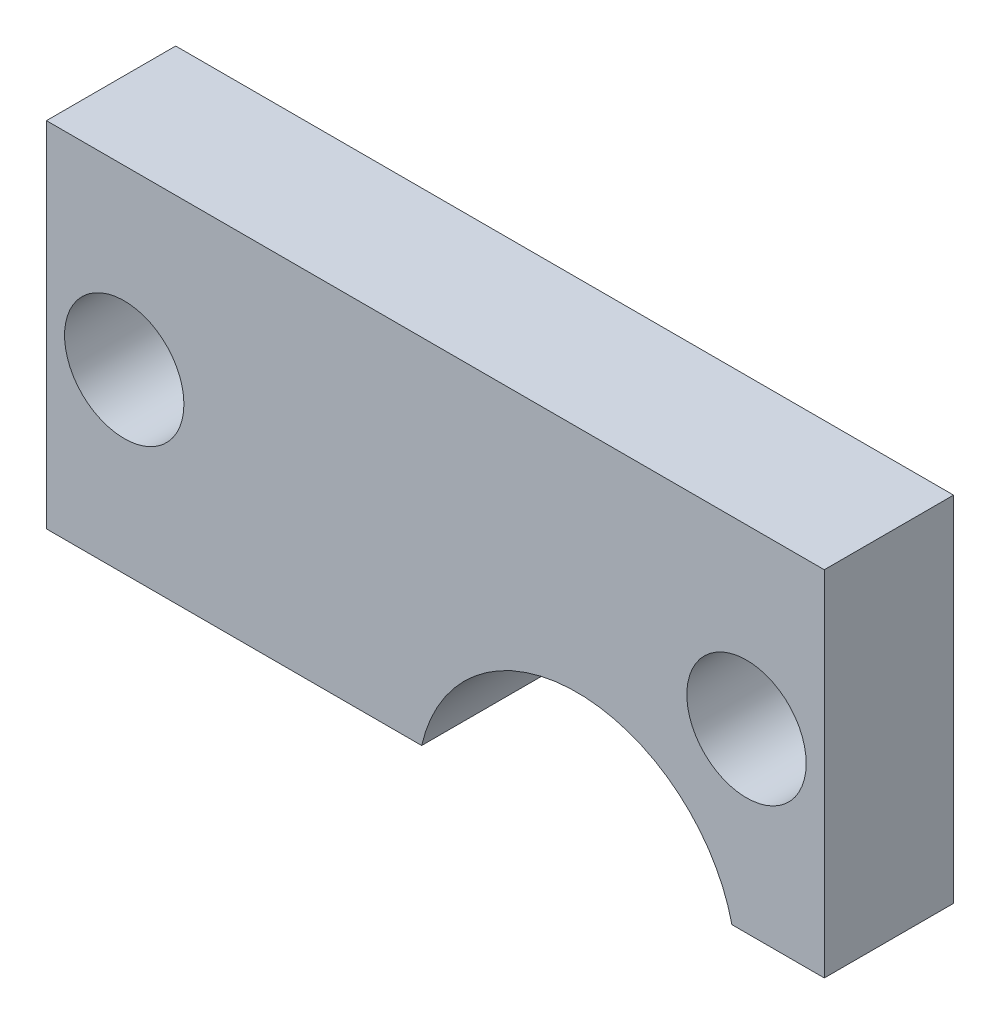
from build123d import *

# Parameters (mm, degrees)
SKETCH1_W           = 69.85
SKETCH1_H           = 31.75
BOSS_EXTRUDE1_DEPTH = 11.6082064
HOLE11_D            = 7.1374
HOLE11_CBORE_D      = 10.7188
HOLE11_CBORE_DEPTH  = 7.874
SKETCH8_R           = 14.2875
CUT_EXTRUDE1_DEPTH  = 711.064649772


with BuildPart() as part:
    # Sketch1 → Boss-Extrude1 (new body)
    with BuildSketch(Plane.XY):
        with Locations((-658.495, -136.525)):
            Rectangle(SKETCH1_W, SKETCH1_H)
    extrude(amount=BOSS_EXTRUDE1_DEPTH)

    # Hole11 (through all)
    with Locations(Plane(origin=(-746.929107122, -135.590000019, 11.6082064), x_dir=(1, 0, 0), z_dir=(0, 0, 1))):
        with Locations((60.494107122, -0.934999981), (116.374107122, -0.934999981)):
            CounterBoreHole(HOLE11_D / 2, HOLE11_CBORE_D / 2, HOLE11_CBORE_DEPTH)

    # Sketch8 → Cut-Extrude1 (cut, through all)
    with BuildSketch(Plane.XY.offset(11.6082064)):
        with Locations((-645.795, -155.575)):
            Circle(SKETCH8_R)
    extrude(amount=-CUT_EXTRUDE1_DEPTH, mode=Mode.SUBTRACT)


solid = part.part
